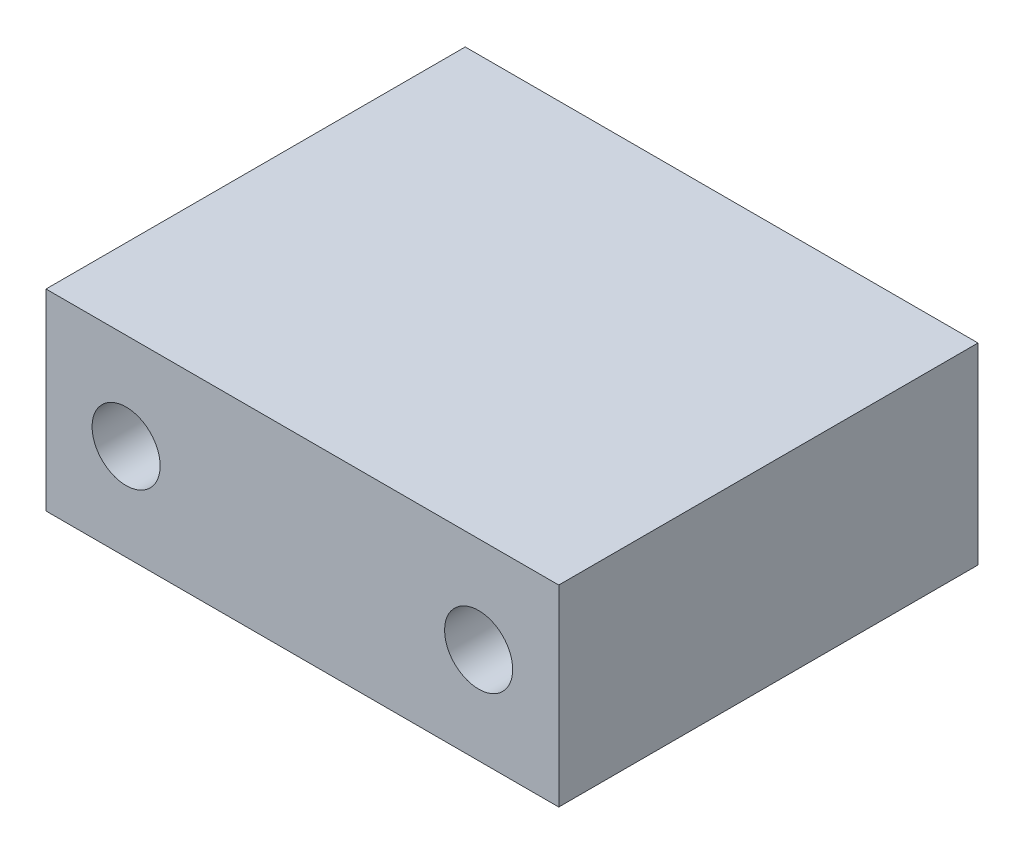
ISO-10303-21;
HEADER;
FILE_DESCRIPTION(('STEP AP214'),'2;1');
FILE_NAME('part.step','',(''),(''),'','','');
FILE_SCHEMA(('AUTOMOTIVE_DESIGN { 1 0 10303 214 1 1 1 1 }'));
ENDSEC;
DATA;
#1=APPLICATION_CONTEXT('core data for automotive mechanical design processes');
#2=APPLICATION_PROTOCOL_DEFINITION('international standard','automotive_design',2000,#1);
#3=PRODUCT_CONTEXT('',#1,'mechanical');
#4=PRODUCT('Part','Part','',(#3));
#5=PRODUCT_RELATED_PRODUCT_CATEGORY('part','',(#4));
#6=PRODUCT_DEFINITION_FORMATION('','',#4);
#7=PRODUCT_DEFINITION_CONTEXT('part definition',#1,'design');
#8=PRODUCT_DEFINITION('design','',#6,#7);
#9=PRODUCT_DEFINITION_SHAPE('','',#8);
#10=(LENGTH_UNIT() NAMED_UNIT(*) SI_UNIT(.MILLI.,.METRE.));
#11=(NAMED_UNIT(*) PLANE_ANGLE_UNIT() SI_UNIT($,.RADIAN.));
#12=(NAMED_UNIT(*) SI_UNIT($,.STERADIAN.) SOLID_ANGLE_UNIT());
#13=UNCERTAINTY_MEASURE_WITH_UNIT(LENGTH_MEASURE(1.E-05),#10,'distance_accuracy_value','');
#14=(GEOMETRIC_REPRESENTATION_CONTEXT(3) GLOBAL_UNCERTAINTY_ASSIGNED_CONTEXT((#13)) GLOBAL_UNIT_ASSIGNED_CONTEXT((#10,
#11,#12)) REPRESENTATION_CONTEXT('',''));
#15=CARTESIAN_POINT('',(0.,0.,0.));
#16=DIRECTION('',(0.,0.,1.));
#17=DIRECTION('',(1.,0.,0.));
#18=AXIS2_PLACEMENT_3D('',#15,#16,#17);
#19=CARTESIAN_POINT('',(-889.,-222.25,-108.508847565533));
#20=DIRECTION('',(-1.,0.,0.));
#21=DIRECTION('',(0.,0.,1.));
#22=AXIS2_PLACEMENT_3D('',#19,#20,#21);
#23=PLANE('',#22);
#24=DIRECTION('',(0.,0.,1.));
#25=VECTOR('',#24,1.);
#26=CARTESIAN_POINT('',(-889.,-222.25,-108.508847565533));
#27=LINE('',#26,#25);
#28=CARTESIAN_POINT('',(-889.,-222.25,1.58749999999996));
#29=VERTEX_POINT('',#28);
#30=CARTESIAN_POINT('',(-889.,-222.25,84.6582));
#31=VERTEX_POINT('',#30);
#32=EDGE_CURVE('E143',#29,#31,#27,.T.);
#33=ORIENTED_EDGE('',*,*,#32,.F.);
#34=DIRECTION('',(0.,-1.,0.));
#35=VECTOR('',#34,1.);
#36=CARTESIAN_POINT('',(-889.,-260.35,1.58749999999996));
#37=LINE('',#36,#35);
#38=CARTESIAN_POINT('',(-889.,-260.35,1.58749999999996));
#39=VERTEX_POINT('',#38);
#40=EDGE_CURVE('E12',#29,#39,#37,.T.);
#41=ORIENTED_EDGE('',*,*,#40,.T.);
#42=DIRECTION('',(0.,0.,1.));
#43=VECTOR('',#42,1.);
#44=CARTESIAN_POINT('',(-889.,-260.35,-108.508847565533));
#45=LINE('',#44,#43);
#46=CARTESIAN_POINT('',(-889.,-260.35,84.6582));
#47=VERTEX_POINT('',#46);
#48=EDGE_CURVE('E104',#39,#47,#45,.T.);
#49=ORIENTED_EDGE('',*,*,#48,.T.);
#50=DIRECTION('',(0.,-1.,0.));
#51=VECTOR('',#50,1.);
#52=CARTESIAN_POINT('',(-889.,-222.25,84.6582));
#53=LINE('',#52,#51);
#54=EDGE_CURVE('E107',#31,#47,#53,.T.);
#55=ORIENTED_EDGE('',*,*,#54,.F.);
#56=EDGE_LOOP('',(#33,#41,#49,#55));
#57=FACE_BOUND('',#56,.T.);
#58=ADVANCED_FACE('F48',(#57),#23,.T.);
#59=CARTESIAN_POINT('',(-787.4,-222.25,-108.508847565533));
#60=DIRECTION('',(0.,1.,0.));
#61=DIRECTION('',(0.,0.,1.));
#62=AXIS2_PLACEMENT_3D('',#59,#60,#61);
#63=PLANE('',#62);
#64=DIRECTION('',(0.,0.,1.));
#65=VECTOR('',#64,1.);
#66=CARTESIAN_POINT('',(-787.4,-222.25,-108.508847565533));
#67=LINE('',#66,#65);
#68=CARTESIAN_POINT('',(-787.4,-222.25,1.58749999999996));
#69=VERTEX_POINT('',#68);
#70=CARTESIAN_POINT('',(-787.4,-222.25,84.6582));
#71=VERTEX_POINT('',#70);
#72=EDGE_CURVE('E147',#69,#71,#67,.T.);
#73=ORIENTED_EDGE('',*,*,#72,.F.);
#74=DIRECTION('',(-1.,0.,0.));
#75=VECTOR('',#74,1.);
#76=CARTESIAN_POINT('',(-889.,-222.25,1.58749999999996));
#77=LINE('',#76,#75);
#78=EDGE_CURVE('E59',#69,#29,#77,.T.);
#79=ORIENTED_EDGE('',*,*,#78,.T.);
#80=ORIENTED_EDGE('',*,*,#32,.T.);
#81=DIRECTION('',(-1.,0.,0.));
#82=VECTOR('',#81,1.);
#83=CARTESIAN_POINT('',(-787.4,-222.25,84.6582));
#84=LINE('',#83,#82);
#85=EDGE_CURVE('E115',#71,#31,#84,.T.);
#86=ORIENTED_EDGE('',*,*,#85,.F.);
#87=EDGE_LOOP('',(#73,#79,#80,#86));
#88=FACE_BOUND('',#87,.T.);
#89=ADVANCED_FACE('F260',(#88),#63,.T.);
#90=CARTESIAN_POINT('',(-787.4,-260.35,-108.508847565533));
#91=DIRECTION('',(1.,0.,0.));
#92=DIRECTION('',(0.,0.,-1.));
#93=AXIS2_PLACEMENT_3D('',#90,#91,#92);
#94=PLANE('',#93);
#95=DIRECTION('',(0.,0.,1.));
#96=VECTOR('',#95,1.);
#97=CARTESIAN_POINT('',(-787.4,-260.35,-108.508847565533));
#98=LINE('',#97,#96);
#99=CARTESIAN_POINT('',(-787.4,-260.35,1.58749999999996));
#100=VERTEX_POINT('',#99);
#101=CARTESIAN_POINT('',(-787.4,-260.35,84.6582));
#102=VERTEX_POINT('',#101);
#103=EDGE_CURVE('E114',#100,#102,#98,.T.);
#104=ORIENTED_EDGE('',*,*,#103,.F.);
#105=DIRECTION('',(0.,1.,0.));
#106=VECTOR('',#105,1.);
#107=CARTESIAN_POINT('',(-787.4,-222.25,1.58749999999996));
#108=LINE('',#107,#106);
#109=EDGE_CURVE('E74',#100,#69,#108,.T.);
#110=ORIENTED_EDGE('',*,*,#109,.T.);
#111=ORIENTED_EDGE('',*,*,#72,.T.);
#112=DIRECTION('',(0.,1.,0.));
#113=VECTOR('',#112,1.);
#114=CARTESIAN_POINT('',(-787.4,-260.35,84.6582));
#115=LINE('',#114,#113);
#116=EDGE_CURVE('E124',#102,#71,#115,.T.);
#117=ORIENTED_EDGE('',*,*,#116,.F.);
#118=EDGE_LOOP('',(#104,#110,#111,#117));
#119=FACE_BOUND('',#118,.T.);
#120=ADVANCED_FACE('F265',(#119),#94,.T.);
#121=CARTESIAN_POINT('',(-889.,-260.35,-108.508847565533));
#122=DIRECTION('',(0.,-1.,0.));
#123=DIRECTION('',(0.,0.,-1.));
#124=AXIS2_PLACEMENT_3D('',#121,#122,#123);
#125=PLANE('',#124);
#126=ORIENTED_EDGE('',*,*,#48,.F.);
#127=DIRECTION('',(1.,0.,0.));
#128=VECTOR('',#127,1.);
#129=CARTESIAN_POINT('',(-787.4,-260.35,1.58749999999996));
#130=LINE('',#129,#128);
#131=EDGE_CURVE('E164',#39,#100,#130,.T.);
#132=ORIENTED_EDGE('',*,*,#131,.T.);
#133=ORIENTED_EDGE('',*,*,#103,.T.);
#134=DIRECTION('',(1.,0.,0.));
#135=VECTOR('',#134,1.);
#136=CARTESIAN_POINT('',(-889.,-260.35,84.6582));
#137=LINE('',#136,#135);
#138=EDGE_CURVE('E118',#47,#102,#137,.T.);
#139=ORIENTED_EDGE('',*,*,#138,.F.);
#140=EDGE_LOOP('',(#126,#132,#133,#139));
#141=FACE_BOUND('',#140,.T.);
#142=ADVANCED_FACE('F119',(#141),#125,.T.);
#143=CARTESIAN_POINT('',(0.,0.,84.6582));
#144=DIRECTION('',(0.,0.,1.));
#145=DIRECTION('',(1.,0.,0.));
#146=AXIS2_PLACEMENT_3D('',#143,#144,#145);
#147=PLANE('',#146);
#148=CARTESIAN_POINT('',(-873.125,-241.3,84.6582));
#149=DIRECTION('',(0.,0.,-1.));
#150=DIRECTION('',(-1.,0.,0.));
#151=AXIS2_PLACEMENT_3D('',#148,#149,#150);
#152=CIRCLE('',#151,6.74624000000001);
#153=CARTESIAN_POINT('',(-879.87124,-241.3,84.6582));
#154=VERTEX_POINT('',#153);
#155=EDGE_CURVE('E210',#154,#154,#152,.T.);
#156=ORIENTED_EDGE('',*,*,#155,.T.);
#157=EDGE_LOOP('',(#156));
#158=FACE_BOUND('',#157,.T.);
#159=CARTESIAN_POINT('',(-803.275,-241.3,84.6582));
#160=DIRECTION('',(0.,0.,-1.));
#161=DIRECTION('',(-1.,0.,0.));
#162=AXIS2_PLACEMENT_3D('',#159,#160,#161);
#163=CIRCLE('',#162,6.74624000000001);
#164=CARTESIAN_POINT('',(-810.02124,-241.3,84.6582));
#165=VERTEX_POINT('',#164);
#166=EDGE_CURVE('E129',#165,#165,#163,.T.);
#167=ORIENTED_EDGE('',*,*,#166,.T.);
#168=EDGE_LOOP('',(#167));
#169=FACE_BOUND('',#168,.T.);
#170=ORIENTED_EDGE('',*,*,#54,.T.);
#171=ORIENTED_EDGE('',*,*,#138,.T.);
#172=ORIENTED_EDGE('',*,*,#116,.T.);
#173=ORIENTED_EDGE('',*,*,#85,.T.);
#174=EDGE_LOOP('',(#170,#171,#172,#173));
#175=FACE_BOUND('',#174,.T.);
#176=ADVANCED_FACE('F126',(#158,#169,#175),#147,.T.);
#177=CARTESIAN_POINT('',(0.,0.,0.));
#178=DIRECTION('',(0.,0.,1.));
#179=DIRECTION('',(1.,0.,0.));
#180=AXIS2_PLACEMENT_3D('',#177,#178,#179);
#181=PLANE('',#180);
#182=DIRECTION('',(0.,-1.,0.));
#183=VECTOR('',#182,1.);
#184=CARTESIAN_POINT('',(-788.9875,-260.35,0.));
#185=LINE('',#184,#183);
#186=CARTESIAN_POINT('',(-788.9875,-223.8375,0.));
#187=VERTEX_POINT('',#186);
#188=CARTESIAN_POINT('',(-788.9875,-258.7625,0.));
#189=VERTEX_POINT('',#188);
#190=EDGE_CURVE('E157',#187,#189,#185,.T.);
#191=ORIENTED_EDGE('',*,*,#190,.T.);
#192=DIRECTION('',(-1.,0.,0.));
#193=VECTOR('',#192,1.);
#194=CARTESIAN_POINT('',(-889.,-258.7625,0.));
#195=LINE('',#194,#193);
#196=CARTESIAN_POINT('',(-887.4125,-258.7625,0.));
#197=VERTEX_POINT('',#196);
#198=EDGE_CURVE('E160',#189,#197,#195,.T.);
#199=ORIENTED_EDGE('',*,*,#198,.T.);
#200=DIRECTION('',(0.,1.,0.));
#201=VECTOR('',#200,1.);
#202=CARTESIAN_POINT('',(-887.4125,-222.25,0.));
#203=LINE('',#202,#201);
#204=CARTESIAN_POINT('',(-887.4125,-223.8375,0.));
#205=VERTEX_POINT('',#204);
#206=EDGE_CURVE('E146',#197,#205,#203,.T.);
#207=ORIENTED_EDGE('',*,*,#206,.T.);
#208=DIRECTION('',(1.,0.,0.));
#209=VECTOR('',#208,1.);
#210=CARTESIAN_POINT('',(-787.4,-223.8375,0.));
#211=LINE('',#210,#209);
#212=EDGE_CURVE('E154',#205,#187,#211,.T.);
#213=ORIENTED_EDGE('',*,*,#212,.T.);
#214=EDGE_LOOP('',(#191,#199,#207,#213));
#215=FACE_BOUND('',#214,.T.);
#216=CARTESIAN_POINT('',(-873.125,-241.3,0.));
#217=DIRECTION('',(0.,0.,-1.));
#218=DIRECTION('',(-1.,0.,0.));
#219=AXIS2_PLACEMENT_3D('',#216,#217,#218);
#220=CIRCLE('',#219,10.31875);
#221=CARTESIAN_POINT('',(-883.44375,-241.3,0.));
#222=VERTEX_POINT('',#221);
#223=EDGE_CURVE('E185',#222,#222,#220,.T.);
#224=ORIENTED_EDGE('',*,*,#223,.F.);
#225=EDGE_LOOP('',(#224));
#226=FACE_BOUND('',#225,.T.);
#227=CARTESIAN_POINT('',(-803.275,-241.3,0.));
#228=DIRECTION('',(0.,0.,-1.));
#229=DIRECTION('',(-1.,0.,0.));
#230=AXIS2_PLACEMENT_3D('',#227,#228,#229);
#231=CIRCLE('',#230,10.31875);
#232=CARTESIAN_POINT('',(-813.59375,-241.3,0.));
#233=VERTEX_POINT('',#232);
#234=EDGE_CURVE('E214',#233,#233,#231,.T.);
#235=ORIENTED_EDGE('',*,*,#234,.F.);
#236=EDGE_LOOP('',(#235));
#237=FACE_BOUND('',#236,.T.);
#238=ADVANCED_FACE('F246',(#215,#226,#237),#181,.F.);
#239=CARTESIAN_POINT('',(-803.275,-241.3,0.));
#240=DIRECTION('',(0.,0.,-1.));
#241=DIRECTION('',(-1.,0.,0.));
#242=AXIS2_PLACEMENT_3D('',#239,#240,#241);
#243=CYLINDRICAL_SURFACE('',#242,6.74624000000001);
#244=ORIENTED_EDGE('',*,*,#166,.F.);
#245=EDGE_LOOP('',(#244));
#246=FACE_BOUND('',#245,.T.);
#247=CARTESIAN_POINT('',(-803.275,-241.3,13.97));
#248=DIRECTION('',(0.,0.,-1.));
#249=DIRECTION('',(-1.,0.,0.));
#250=AXIS2_PLACEMENT_3D('',#247,#248,#249);
#251=CIRCLE('',#250,6.74624000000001);
#252=CARTESIAN_POINT('',(-810.02124,-241.3,13.97));
#253=VERTEX_POINT('',#252);
#254=EDGE_CURVE('E134',#253,#253,#251,.T.);
#255=ORIENTED_EDGE('',*,*,#254,.T.);
#256=EDGE_LOOP('',(#255));
#257=FACE_BOUND('',#256,.T.);
#258=ADVANCED_FACE('F231',(#246,#257),#243,.F.);
#259=CARTESIAN_POINT('',(-796.52876,-241.3,13.97));
#260=DIRECTION('',(0.,0.,1.));
#261=DIRECTION('',(1.,0.,0.));
#262=AXIS2_PLACEMENT_3D('',#259,#260,#261);
#263=PLANE('',#262);
#264=ORIENTED_EDGE('',*,*,#254,.F.);
#265=EDGE_LOOP('',(#264));
#266=FACE_BOUND('',#265,.T.);
#267=CARTESIAN_POINT('',(-803.275,-241.3,13.97));
#268=DIRECTION('',(0.,0.,-1.));
#269=DIRECTION('',(-1.,0.,0.));
#270=AXIS2_PLACEMENT_3D('',#267,#268,#269);
#271=CIRCLE('',#270,10.31875);
#272=CARTESIAN_POINT('',(-813.59375,-241.3,13.97));
#273=VERTEX_POINT('',#272);
#274=EDGE_CURVE('E219',#273,#273,#271,.T.);
#275=ORIENTED_EDGE('',*,*,#274,.T.);
#276=EDGE_LOOP('',(#275));
#277=FACE_BOUND('',#276,.T.);
#278=ADVANCED_FACE('F233',(#266,#277),#263,.F.);
#279=CARTESIAN_POINT('',(-803.275,-241.3,0.));
#280=DIRECTION('',(0.,0.,-1.));
#281=DIRECTION('',(-1.,0.,0.));
#282=AXIS2_PLACEMENT_3D('',#279,#280,#281);
#283=CYLINDRICAL_SURFACE('',#282,10.31875);
#284=ORIENTED_EDGE('',*,*,#274,.F.);
#285=EDGE_LOOP('',(#284));
#286=FACE_BOUND('',#285,.T.);
#287=ORIENTED_EDGE('',*,*,#234,.T.);
#288=EDGE_LOOP('',(#287));
#289=FACE_BOUND('',#288,.T.);
#290=ADVANCED_FACE('F236',(#286,#289),#283,.F.);
#291=CARTESIAN_POINT('',(-873.125,-241.3,0.));
#292=DIRECTION('',(0.,0.,-1.));
#293=DIRECTION('',(-1.,0.,0.));
#294=AXIS2_PLACEMENT_3D('',#291,#292,#293);
#295=CYLINDRICAL_SURFACE('',#294,6.74624000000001);
#296=ORIENTED_EDGE('',*,*,#155,.F.);
#297=EDGE_LOOP('',(#296));
#298=FACE_BOUND('',#297,.T.);
#299=CARTESIAN_POINT('',(-873.125,-241.3,13.97));
#300=DIRECTION('',(0.,0.,-1.));
#301=DIRECTION('',(-1.,0.,0.));
#302=AXIS2_PLACEMENT_3D('',#299,#300,#301);
#303=CIRCLE('',#302,6.74624000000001);
#304=CARTESIAN_POINT('',(-879.87124,-241.3,13.97));
#305=VERTEX_POINT('',#304);
#306=EDGE_CURVE('E198',#305,#305,#303,.T.);
#307=ORIENTED_EDGE('',*,*,#306,.T.);
#308=EDGE_LOOP('',(#307));
#309=FACE_BOUND('',#308,.T.);
#310=ADVANCED_FACE('F242',(#298,#309),#295,.F.);
#311=CARTESIAN_POINT('',(-866.37876,-241.3,13.97));
#312=DIRECTION('',(0.,0.,1.));
#313=DIRECTION('',(1.,0.,0.));
#314=AXIS2_PLACEMENT_3D('',#311,#312,#313);
#315=PLANE('',#314);
#316=ORIENTED_EDGE('',*,*,#306,.F.);
#317=EDGE_LOOP('',(#316));
#318=FACE_BOUND('',#317,.T.);
#319=CARTESIAN_POINT('',(-873.125,-241.3,13.97));
#320=DIRECTION('',(0.,0.,-1.));
#321=DIRECTION('',(-1.,0.,0.));
#322=AXIS2_PLACEMENT_3D('',#319,#320,#321);
#323=CIRCLE('',#322,10.31875);
#324=CARTESIAN_POINT('',(-883.44375,-241.3,13.97));
#325=VERTEX_POINT('',#324);
#326=EDGE_CURVE('E192',#325,#325,#323,.T.);
#327=ORIENTED_EDGE('',*,*,#326,.T.);
#328=EDGE_LOOP('',(#327));
#329=FACE_BOUND('',#328,.T.);
#330=ADVANCED_FACE('F295',(#318,#329),#315,.F.);
#331=CARTESIAN_POINT('',(-873.125,-241.3,0.));
#332=DIRECTION('',(0.,0.,-1.));
#333=DIRECTION('',(-1.,0.,0.));
#334=AXIS2_PLACEMENT_3D('',#331,#332,#333);
#335=CYLINDRICAL_SURFACE('',#334,10.31875);
#336=ORIENTED_EDGE('',*,*,#326,.F.);
#337=EDGE_LOOP('',(#336));
#338=FACE_BOUND('',#337,.T.);
#339=ORIENTED_EDGE('',*,*,#223,.T.);
#340=EDGE_LOOP('',(#339));
#341=FACE_BOUND('',#340,.T.);
#342=ADVANCED_FACE('F290',(#338,#341),#335,.F.);
#343=CARTESIAN_POINT('',(0.,-223.8375,0.));
#344=DIRECTION('',(0.,0.707106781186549,-0.707106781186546));
#345=DIRECTION('',(-1.,0.,0.));
#346=AXIS2_PLACEMENT_3D('',#343,#344,#345);
#347=PLANE('',#346);
#348=DIRECTION('',(0.577350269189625,-0.577350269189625,-0.577350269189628));
#349=VECTOR('',#348,1.);
#350=CARTESIAN_POINT('',(-962.025,-149.225,74.6125000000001));
#351=LINE('',#350,#349);
#352=EDGE_CURVE('E176',#29,#205,#351,.T.);
#353=ORIENTED_EDGE('',*,*,#352,.F.);
#354=ORIENTED_EDGE('',*,*,#78,.F.);
#355=DIRECTION('',(-0.577350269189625,-0.577350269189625,-0.577350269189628));
#356=VECTOR('',#355,1.);
#357=CARTESIAN_POINT('',(-525.991666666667,39.1583333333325,262.995833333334));
#358=LINE('',#357,#356);
#359=EDGE_CURVE('E53',#187,#69,#358,.F.);
#360=ORIENTED_EDGE('',*,*,#359,.F.);
#361=ORIENTED_EDGE('',*,*,#212,.F.);
#362=EDGE_LOOP('',(#353,#354,#360,#361));
#363=FACE_BOUND('',#362,.T.);
#364=ADVANCED_FACE('F51',(#363),#347,.T.);
#365=CARTESIAN_POINT('',(-788.9875,0.,0.));
#366=DIRECTION('',(0.707106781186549,0.,-0.707106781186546));
#367=DIRECTION('',(0.,1.,0.));
#368=AXIS2_PLACEMENT_3D('',#365,#366,#367);
#369=PLANE('',#368);
#370=ORIENTED_EDGE('',*,*,#359,.T.);
#371=ORIENTED_EDGE('',*,*,#109,.F.);
#372=DIRECTION('',(-0.577350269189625,0.577350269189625,-0.577350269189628));
#373=VECTOR('',#372,1.);
#374=CARTESIAN_POINT('',(-875.241666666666,-172.508333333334,-86.2541666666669));
#375=LINE('',#374,#373);
#376=EDGE_CURVE('E174',#189,#100,#375,.F.);
#377=ORIENTED_EDGE('',*,*,#376,.F.);
#378=ORIENTED_EDGE('',*,*,#190,.F.);
#379=EDGE_LOOP('',(#370,#371,#377,#378));
#380=FACE_BOUND('',#379,.T.);
#381=ADVANCED_FACE('F283',(#380),#369,.T.);
#382=CARTESIAN_POINT('',(-887.4125,0.,0.));
#383=DIRECTION('',(-0.707106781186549,0.,-0.707106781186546));
#384=DIRECTION('',(0.,-1.,0.));
#385=AXIS2_PLACEMENT_3D('',#382,#383,#384);
#386=PLANE('',#385);
#387=ORIENTED_EDGE('',*,*,#352,.T.);
#388=ORIENTED_EDGE('',*,*,#206,.F.);
#389=DIRECTION('',(-0.577350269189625,-0.577350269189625,0.577350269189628));
#390=VECTOR('',#389,1.);
#391=CARTESIAN_POINT('',(-801.158333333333,-172.508333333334,-86.2541666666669));
#392=LINE('',#391,#390);
#393=EDGE_CURVE('E171',#39,#197,#392,.F.);
#394=ORIENTED_EDGE('',*,*,#393,.F.);
#395=ORIENTED_EDGE('',*,*,#40,.F.);
#396=EDGE_LOOP('',(#387,#388,#394,#395));
#397=FACE_BOUND('',#396,.T.);
#398=ADVANCED_FACE('F277',(#397),#386,.T.);
#399=CARTESIAN_POINT('',(0.,-258.7625,0.));
#400=DIRECTION('',(0.,-0.707106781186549,-0.707106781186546));
#401=DIRECTION('',(1.,0.,0.));
#402=AXIS2_PLACEMENT_3D('',#399,#400,#401);
#403=PLANE('',#402);
#404=ORIENTED_EDGE('',*,*,#376,.T.);
#405=ORIENTED_EDGE('',*,*,#131,.F.);
#406=ORIENTED_EDGE('',*,*,#393,.T.);
#407=ORIENTED_EDGE('',*,*,#198,.F.);
#408=EDGE_LOOP('',(#404,#405,#406,#407));
#409=FACE_BOUND('',#408,.T.);
#410=ADVANCED_FACE('F271',(#409),#403,.T.);
#411=CLOSED_SHELL('',(#58,#89,#120,#142,#176,#238,#258,#278,#290,#310,#330,#342,#364,#381,#398,#410));
#412=MANIFOLD_SOLID_BREP('B2',#411);
#413=ADVANCED_BREP_SHAPE_REPRESENTATION('',(#18,#412),#14);
#414=SHAPE_DEFINITION_REPRESENTATION(#9,#413);
ENDSEC;
END-ISO-10303-21;
